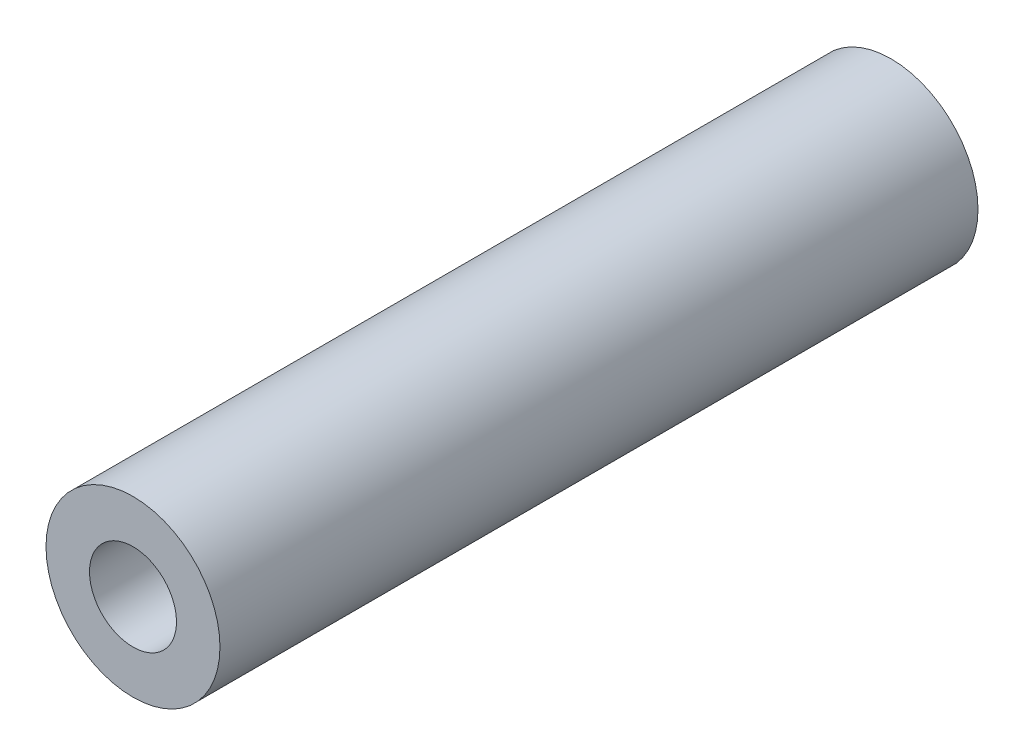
from build123d import *

# Parameters (mm, degrees)
ESQUISSE1_R      = 3.5
ESQUISSE1_R_2    = 1.75
EXTRUSION1_DEPTH = 15.25


with BuildPart() as part:
    # Esquisse1 → Extrusion1 (new, symmetric)
    with BuildSketch(Plane.XY):
        with Locations(Location((0, 0, 0), (0, 0, 180))):
            Circle(ESQUISSE1_R)
        with Locations(Location((0, 0, 0), (0, 0, 180))):
            Circle(ESQUISSE1_R_2, mode=Mode.SUBTRACT)
    extrude(amount=EXTRUSION1_DEPTH, both=True)


solid = part.part
